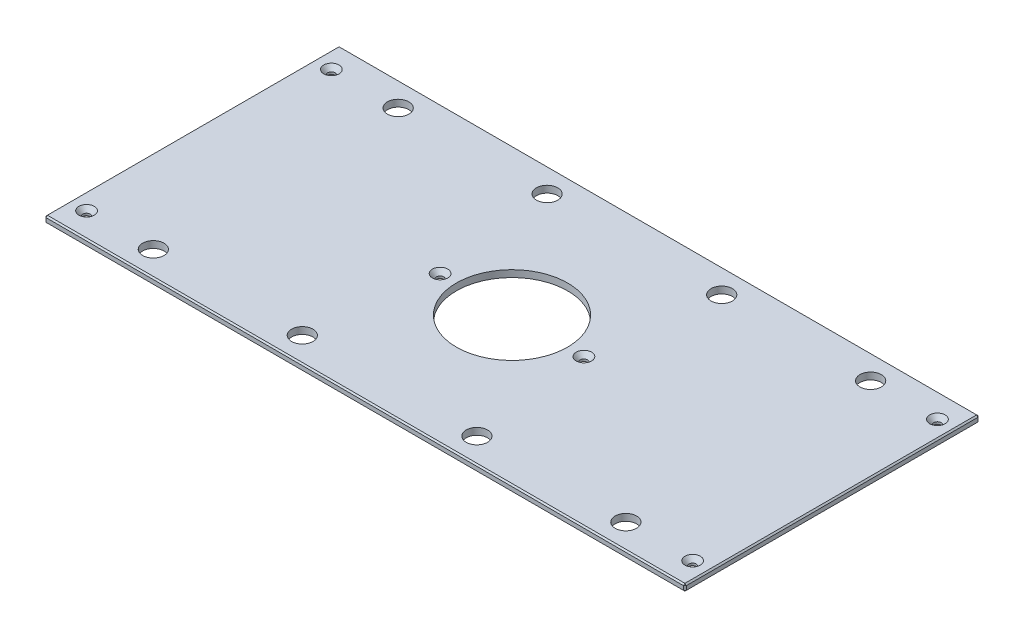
ISO-10303-21;
HEADER;
FILE_DESCRIPTION(('STEP AP214'),'2;1');
FILE_NAME('part.step','',(''),(''),'','','');
FILE_SCHEMA(('AUTOMOTIVE_DESIGN { 1 0 10303 214 1 1 1 1 }'));
ENDSEC;
DATA;
#1=APPLICATION_CONTEXT('core data for automotive mechanical design processes');
#2=APPLICATION_PROTOCOL_DEFINITION('international standard','automotive_design',2000,#1);
#3=PRODUCT_CONTEXT('',#1,'mechanical');
#4=PRODUCT('Part','Part','',(#3));
#5=PRODUCT_RELATED_PRODUCT_CATEGORY('part','',(#4));
#6=PRODUCT_DEFINITION_FORMATION('','',#4);
#7=PRODUCT_DEFINITION_CONTEXT('part definition',#1,'design');
#8=PRODUCT_DEFINITION('design','',#6,#7);
#9=PRODUCT_DEFINITION_SHAPE('','',#8);
#10=(LENGTH_UNIT() NAMED_UNIT(*) SI_UNIT(.MILLI.,.METRE.));
#11=(NAMED_UNIT(*) PLANE_ANGLE_UNIT() SI_UNIT($,.RADIAN.));
#12=(NAMED_UNIT(*) SI_UNIT($,.STERADIAN.) SOLID_ANGLE_UNIT());
#13=UNCERTAINTY_MEASURE_WITH_UNIT(LENGTH_MEASURE(1.E-05),#10,'distance_accuracy_value','');
#14=(GEOMETRIC_REPRESENTATION_CONTEXT(3) GLOBAL_UNCERTAINTY_ASSIGNED_CONTEXT((#13)) GLOBAL_UNIT_ASSIGNED_CONTEXT((#10,
#11,#12)) REPRESENTATION_CONTEXT('',''));
#15=CARTESIAN_POINT('',(0.,0.,0.));
#16=DIRECTION('',(0.,0.,1.));
#17=DIRECTION('',(1.,0.,0.));
#18=AXIS2_PLACEMENT_3D('',#15,#16,#17);
#19=CARTESIAN_POINT('',(-296.8625,6.35,-136.525));
#20=DIRECTION('',(1.,0.,0.));
#21=DIRECTION('',(0.,0.,-1.));
#22=AXIS2_PLACEMENT_3D('',#19,#20,#21);
#23=PLANE('',#22);
#24=DIRECTION('',(0.,0.,-1.));
#25=VECTOR('',#24,1.);
#26=CARTESIAN_POINT('',(-296.8625,5.08000000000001,-136.525));
#27=LINE('',#26,#25);
#28=CARTESIAN_POINT('',(-296.8625,5.08000000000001,135.255));
#29=VERTEX_POINT('',#28);
#30=CARTESIAN_POINT('',(-296.8625,5.08000000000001,-135.255));
#31=VERTEX_POINT('',#30);
#32=EDGE_CURVE('E136',#29,#31,#27,.T.);
#33=ORIENTED_EDGE('',*,*,#32,.T.);
#34=DIRECTION('',(0.,-1.,0.));
#35=VECTOR('',#34,1.);
#36=CARTESIAN_POINT('',(-296.8625,6.35,-135.255));
#37=LINE('',#36,#35);
#38=CARTESIAN_POINT('',(-296.8625,1.26999999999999,-135.255));
#39=VERTEX_POINT('',#38);
#40=EDGE_CURVE('E132',#31,#39,#37,.T.);
#41=ORIENTED_EDGE('',*,*,#40,.T.);
#42=DIRECTION('',(0.,0.,1.));
#43=VECTOR('',#42,1.);
#44=CARTESIAN_POINT('',(-296.8625,1.26999999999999,-136.525));
#45=LINE('',#44,#43);
#46=CARTESIAN_POINT('',(-296.8625,1.26999999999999,135.255));
#47=VERTEX_POINT('',#46);
#48=EDGE_CURVE('E127',#39,#47,#45,.T.);
#49=ORIENTED_EDGE('',*,*,#48,.T.);
#50=DIRECTION('',(0.,1.,0.));
#51=VECTOR('',#50,1.);
#52=CARTESIAN_POINT('',(-296.8625,6.35,135.255));
#53=LINE('',#52,#51);
#54=EDGE_CURVE('E129',#47,#29,#53,.T.);
#55=ORIENTED_EDGE('',*,*,#54,.T.);
#56=EDGE_LOOP('',(#33,#41,#49,#55));
#57=FACE_BOUND('',#56,.T.);
#58=ADVANCED_FACE('F36',(#57),#23,.F.);
#59=CARTESIAN_POINT('',(-296.8625,6.35,136.525));
#60=DIRECTION('',(0.,0.,-1.));
#61=DIRECTION('',(-1.,0.,0.));
#62=AXIS2_PLACEMENT_3D('',#59,#60,#61);
#63=PLANE('',#62);
#64=DIRECTION('',(1.,0.,0.));
#65=VECTOR('',#64,1.);
#66=CARTESIAN_POINT('',(-296.8625,1.26999999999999,136.525));
#67=LINE('',#66,#65);
#68=CARTESIAN_POINT('',(-295.5925,1.26999999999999,136.525));
#69=VERTEX_POINT('',#68);
#70=CARTESIAN_POINT('',(295.5925,1.26999999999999,136.525));
#71=VERTEX_POINT('',#70);
#72=EDGE_CURVE('E59',#69,#71,#67,.T.);
#73=ORIENTED_EDGE('',*,*,#72,.T.);
#74=DIRECTION('',(0.,1.,0.));
#75=VECTOR('',#74,1.);
#76=CARTESIAN_POINT('',(295.5925,6.35,136.525));
#77=LINE('',#76,#75);
#78=CARTESIAN_POINT('',(295.5925,5.08000000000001,136.525));
#79=VERTEX_POINT('',#78);
#80=EDGE_CURVE('E11',#71,#79,#77,.T.);
#81=ORIENTED_EDGE('',*,*,#80,.T.);
#82=DIRECTION('',(-1.,0.,0.));
#83=VECTOR('',#82,1.);
#84=CARTESIAN_POINT('',(-296.8625,5.08000000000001,136.525));
#85=LINE('',#84,#83);
#86=CARTESIAN_POINT('',(-295.5925,5.08000000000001,136.525));
#87=VERTEX_POINT('',#86);
#88=EDGE_CURVE('E45',#79,#87,#85,.T.);
#89=ORIENTED_EDGE('',*,*,#88,.T.);
#90=DIRECTION('',(0.,-1.,0.));
#91=VECTOR('',#90,1.);
#92=CARTESIAN_POINT('',(-295.5925,6.35,136.525));
#93=LINE('',#92,#91);
#94=EDGE_CURVE('E304',#87,#69,#93,.T.);
#95=ORIENTED_EDGE('',*,*,#94,.T.);
#96=EDGE_LOOP('',(#73,#81,#89,#95));
#97=FACE_BOUND('',#96,.T.);
#98=ADVANCED_FACE('F373',(#97),#63,.F.);
#99=CARTESIAN_POINT('',(296.8625,6.35,-136.525));
#100=DIRECTION('',(-1.,0.,0.));
#101=DIRECTION('',(0.,0.,1.));
#102=AXIS2_PLACEMENT_3D('',#99,#100,#101);
#103=PLANE('',#102);
#104=DIRECTION('',(0.,0.,-1.));
#105=VECTOR('',#104,1.);
#106=CARTESIAN_POINT('',(296.8625,1.26999999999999,-136.525));
#107=LINE('',#106,#105);
#108=CARTESIAN_POINT('',(296.8625,1.26999999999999,135.255));
#109=VERTEX_POINT('',#108);
#110=CARTESIAN_POINT('',(296.8625,1.26999999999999,-135.255));
#111=VERTEX_POINT('',#110);
#112=EDGE_CURVE('E299',#109,#111,#107,.T.);
#113=ORIENTED_EDGE('',*,*,#112,.T.);
#114=DIRECTION('',(0.,1.,0.));
#115=VECTOR('',#114,1.);
#116=CARTESIAN_POINT('',(296.8625,6.35,-135.255));
#117=LINE('',#116,#115);
#118=CARTESIAN_POINT('',(296.8625,5.08000000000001,-135.255));
#119=VERTEX_POINT('',#118);
#120=EDGE_CURVE('E301',#111,#119,#117,.T.);
#121=ORIENTED_EDGE('',*,*,#120,.T.);
#122=DIRECTION('',(0.,0.,1.));
#123=VECTOR('',#122,1.);
#124=CARTESIAN_POINT('',(296.8625,5.08000000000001,136.525));
#125=LINE('',#124,#123);
#126=CARTESIAN_POINT('',(296.8625,5.08000000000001,135.255));
#127=VERTEX_POINT('',#126);
#128=EDGE_CURVE('E297',#119,#127,#125,.T.);
#129=ORIENTED_EDGE('',*,*,#128,.T.);
#130=DIRECTION('',(0.,-1.,0.));
#131=VECTOR('',#130,1.);
#132=CARTESIAN_POINT('',(296.8625,6.35,135.255));
#133=LINE('',#132,#131);
#134=EDGE_CURVE('E295',#127,#109,#133,.T.);
#135=ORIENTED_EDGE('',*,*,#134,.T.);
#136=EDGE_LOOP('',(#113,#121,#129,#135));
#137=FACE_BOUND('',#136,.T.);
#138=ADVANCED_FACE('F360',(#137),#103,.F.);
#139=CARTESIAN_POINT('',(-296.8625,6.35,-136.525));
#140=DIRECTION('',(0.,0.,1.));
#141=DIRECTION('',(1.,0.,0.));
#142=AXIS2_PLACEMENT_3D('',#139,#140,#141);
#143=PLANE('',#142);
#144=DIRECTION('',(-1.,0.,0.));
#145=VECTOR('',#144,1.);
#146=CARTESIAN_POINT('',(-296.8625,1.26999999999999,-136.525));
#147=LINE('',#146,#145);
#148=CARTESIAN_POINT('',(295.5925,1.26999999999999,-136.525));
#149=VERTEX_POINT('',#148);
#150=CARTESIAN_POINT('',(-295.5925,1.26999999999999,-136.525));
#151=VERTEX_POINT('',#150);
#152=EDGE_CURVE('E271',#149,#151,#147,.T.);
#153=ORIENTED_EDGE('',*,*,#152,.T.);
#154=DIRECTION('',(0.,1.,0.));
#155=VECTOR('',#154,1.);
#156=CARTESIAN_POINT('',(-295.5925,6.35,-136.525));
#157=LINE('',#156,#155);
#158=CARTESIAN_POINT('',(-295.5925,5.08000000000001,-136.525));
#159=VERTEX_POINT('',#158);
#160=EDGE_CURVE('E275',#151,#159,#157,.T.);
#161=ORIENTED_EDGE('',*,*,#160,.T.);
#162=DIRECTION('',(1.,0.,0.));
#163=VECTOR('',#162,1.);
#164=CARTESIAN_POINT('',(296.8625,5.08000000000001,-136.525));
#165=LINE('',#164,#163);
#166=CARTESIAN_POINT('',(295.5925,5.08000000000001,-136.525));
#167=VERTEX_POINT('',#166);
#168=EDGE_CURVE('E273',#159,#167,#165,.T.);
#169=ORIENTED_EDGE('',*,*,#168,.T.);
#170=DIRECTION('',(0.,-1.,0.));
#171=VECTOR('',#170,1.);
#172=CARTESIAN_POINT('',(295.5925,6.35,-136.525));
#173=LINE('',#172,#171);
#174=EDGE_CURVE('E269',#167,#149,#173,.T.);
#175=ORIENTED_EDGE('',*,*,#174,.T.);
#176=EDGE_LOOP('',(#153,#161,#169,#175));
#177=FACE_BOUND('',#176,.T.);
#178=ADVANCED_FACE('F334',(#177),#143,.F.);
#179=CARTESIAN_POINT('',(0.,6.35,0.));
#180=DIRECTION('',(0.,1.,0.));
#181=DIRECTION('',(0.,0.,1.));
#182=AXIS2_PLACEMENT_3D('',#179,#180,#181);
#183=PLANE('',#182);
#184=CARTESIAN_POINT('',(280.9875,6.35,-113.50498));
#185=DIRECTION('',(0.,1.,0.));
#186=DIRECTION('',(0.,0.,1.));
#187=AXIS2_PLACEMENT_3D('',#184,#185,#186);
#188=CIRCLE('',#187,7.13740000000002);
#189=CARTESIAN_POINT('',(280.9875,6.35,-106.36758));
#190=VERTEX_POINT('',#189);
#191=EDGE_CURVE('E817',#190,#190,#188,.T.);
#192=ORIENTED_EDGE('',*,*,#191,.F.);
#193=EDGE_LOOP('',(#192));
#194=FACE_BOUND('',#193,.T.);
#195=CARTESIAN_POINT('',(280.9875,6.35,113.50498));
#196=DIRECTION('',(0.,1.,0.));
#197=DIRECTION('',(0.,0.,1.));
#198=AXIS2_PLACEMENT_3D('',#195,#196,#197);
#199=CIRCLE('',#198,7.13740000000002);
#200=CARTESIAN_POINT('',(280.9875,6.35,120.64238));
#201=VERTEX_POINT('',#200);
#202=EDGE_CURVE('E821',#201,#201,#199,.T.);
#203=ORIENTED_EDGE('',*,*,#202,.F.);
#204=EDGE_LOOP('',(#203));
#205=FACE_BOUND('',#204,.T.);
#206=CARTESIAN_POINT('',(-280.9875,6.35,113.50498));
#207=DIRECTION('',(0.,1.,0.));
#208=DIRECTION('',(0.,0.,1.));
#209=AXIS2_PLACEMENT_3D('',#206,#207,#208);
#210=CIRCLE('',#209,7.13740000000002);
#211=CARTESIAN_POINT('',(-280.9875,6.35,120.64238));
#212=VERTEX_POINT('',#211);
#213=EDGE_CURVE('E825',#212,#212,#210,.T.);
#214=ORIENTED_EDGE('',*,*,#213,.F.);
#215=EDGE_LOOP('',(#214));
#216=FACE_BOUND('',#215,.T.);
#217=CARTESIAN_POINT('',(-66.675,6.35,0.));
#218=DIRECTION('',(0.,1.,0.));
#219=DIRECTION('',(0.,0.,1.));
#220=AXIS2_PLACEMENT_3D('',#217,#218,#219);
#221=CIRCLE('',#220,7.1374);
#222=CARTESIAN_POINT('',(-66.675,6.35,7.1374));
#223=VERTEX_POINT('',#222);
#224=EDGE_CURVE('E829',#223,#223,#221,.T.);
#225=ORIENTED_EDGE('',*,*,#224,.F.);
#226=EDGE_LOOP('',(#225));
#227=FACE_BOUND('',#226,.T.);
#228=CARTESIAN_POINT('',(66.675,6.35,0.));
#229=DIRECTION('',(0.,1.,0.));
#230=DIRECTION('',(0.,0.,1.));
#231=AXIS2_PLACEMENT_3D('',#228,#229,#230);
#232=CIRCLE('',#231,7.1374);
#233=CARTESIAN_POINT('',(66.675,6.35,7.1374));
#234=VERTEX_POINT('',#233);
#235=EDGE_CURVE('E833',#234,#234,#232,.T.);
#236=ORIENTED_EDGE('',*,*,#235,.F.);
#237=EDGE_LOOP('',(#236));
#238=FACE_BOUND('',#237,.T.);
#239=CARTESIAN_POINT('',(-280.9875,6.35,-113.50498));
#240=DIRECTION('',(0.,1.,0.));
#241=DIRECTION('',(0.,0.,1.));
#242=AXIS2_PLACEMENT_3D('',#239,#240,#241);
#243=CIRCLE('',#242,7.13740000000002);
#244=CARTESIAN_POINT('',(-280.9875,6.35,-106.36758));
#245=VERTEX_POINT('',#244);
#246=EDGE_CURVE('E836',#245,#245,#243,.T.);
#247=ORIENTED_EDGE('',*,*,#246,.F.);
#248=EDGE_LOOP('',(#247));
#249=FACE_BOUND('',#248,.T.);
#250=DIRECTION('',(0.,0.,-1.));
#251=VECTOR('',#250,1.);
#252=CARTESIAN_POINT('',(295.5925,6.35,-136.525));
#253=LINE('',#252,#251);
#254=CARTESIAN_POINT('',(295.5925,6.35,135.255));
#255=VERTEX_POINT('',#254);
#256=CARTESIAN_POINT('',(295.5925,6.35,-135.255));
#257=VERTEX_POINT('',#256);
#258=EDGE_CURVE('E282',#255,#257,#253,.T.);
#259=ORIENTED_EDGE('',*,*,#258,.T.);
#260=DIRECTION('',(-1.,0.,0.));
#261=VECTOR('',#260,1.);
#262=CARTESIAN_POINT('',(-296.8625,6.35,-135.255));
#263=LINE('',#262,#261);
#264=CARTESIAN_POINT('',(-295.5925,6.35,-135.255));
#265=VERTEX_POINT('',#264);
#266=EDGE_CURVE('E284',#257,#265,#263,.T.);
#267=ORIENTED_EDGE('',*,*,#266,.T.);
#268=DIRECTION('',(0.,0.,1.));
#269=VECTOR('',#268,1.);
#270=CARTESIAN_POINT('',(-295.5925,6.35,136.525));
#271=LINE('',#270,#269);
#272=CARTESIAN_POINT('',(-295.5925,6.35,135.255));
#273=VERTEX_POINT('',#272);
#274=EDGE_CURVE('E280',#265,#273,#271,.T.);
#275=ORIENTED_EDGE('',*,*,#274,.T.);
#276=DIRECTION('',(1.,0.,0.));
#277=VECTOR('',#276,1.);
#278=CARTESIAN_POINT('',(296.8625,6.35,135.255));
#279=LINE('',#278,#277);
#280=EDGE_CURVE('E278',#273,#255,#279,.T.);
#281=ORIENTED_EDGE('',*,*,#280,.T.);
#282=EDGE_LOOP('',(#259,#267,#275,#281));
#283=FACE_BOUND('',#282,.T.);
#284=CARTESIAN_POINT('',(219.075,6.35,-113.50498));
#285=DIRECTION('',(0.,1.,0.));
#286=DIRECTION('',(0.,0.,1.));
#287=AXIS2_PLACEMENT_3D('',#284,#285,#286);
#288=CIRCLE('',#287,9.921875);
#289=CARTESIAN_POINT('',(219.075,6.35,-103.583105));
#290=VERTEX_POINT('',#289);
#291=EDGE_CURVE('E205',#290,#290,#288,.T.);
#292=ORIENTED_EDGE('',*,*,#291,.F.);
#293=EDGE_LOOP('',(#292));
#294=FACE_BOUND('',#293,.T.);
#295=CARTESIAN_POINT('',(-219.075,6.35,-113.50498));
#296=DIRECTION('',(0.,1.,0.));
#297=DIRECTION('',(0.,0.,1.));
#298=AXIS2_PLACEMENT_3D('',#295,#296,#297);
#299=CIRCLE('',#298,9.921875);
#300=CARTESIAN_POINT('',(-219.075,6.35,-103.583105));
#301=VERTEX_POINT('',#300);
#302=EDGE_CURVE('E215',#301,#301,#299,.T.);
#303=ORIENTED_EDGE('',*,*,#302,.F.);
#304=EDGE_LOOP('',(#303));
#305=FACE_BOUND('',#304,.T.);
#306=CARTESIAN_POINT('',(219.075,6.35,113.50498));
#307=DIRECTION('',(0.,1.,0.));
#308=DIRECTION('',(0.,0.,1.));
#309=AXIS2_PLACEMENT_3D('',#306,#307,#308);
#310=CIRCLE('',#309,9.921875);
#311=CARTESIAN_POINT('',(219.075,6.35,123.426855));
#312=VERTEX_POINT('',#311);
#313=EDGE_CURVE('E226',#312,#312,#310,.T.);
#314=ORIENTED_EDGE('',*,*,#313,.F.);
#315=EDGE_LOOP('',(#314));
#316=FACE_BOUND('',#315,.T.);
#317=CARTESIAN_POINT('',(-219.075,6.35,113.50498));
#318=DIRECTION('',(0.,1.,0.));
#319=DIRECTION('',(0.,0.,1.));
#320=AXIS2_PLACEMENT_3D('',#317,#318,#319);
#321=CIRCLE('',#320,9.921875);
#322=CARTESIAN_POINT('',(-219.075,6.35,123.426855));
#323=VERTEX_POINT('',#322);
#324=EDGE_CURVE('E232',#323,#323,#321,.T.);
#325=ORIENTED_EDGE('',*,*,#324,.F.);
#326=EDGE_LOOP('',(#325));
#327=FACE_BOUND('',#326,.T.);
#328=CARTESIAN_POINT('',(-80.9625,6.35,-113.50498));
#329=DIRECTION('',(0.,1.,0.));
#330=DIRECTION('',(0.,0.,1.));
#331=AXIS2_PLACEMENT_3D('',#328,#329,#330);
#332=CIRCLE('',#331,9.921875);
#333=CARTESIAN_POINT('',(-80.9625,6.35,-103.583105));
#334=VERTEX_POINT('',#333);
#335=EDGE_CURVE('E238',#334,#334,#332,.T.);
#336=ORIENTED_EDGE('',*,*,#335,.F.);
#337=EDGE_LOOP('',(#336));
#338=FACE_BOUND('',#337,.T.);
#339=CARTESIAN_POINT('',(80.9625,6.35,-113.50498));
#340=DIRECTION('',(0.,1.,0.));
#341=DIRECTION('',(0.,0.,1.));
#342=AXIS2_PLACEMENT_3D('',#339,#340,#341);
#343=CIRCLE('',#342,9.921875);
#344=CARTESIAN_POINT('',(80.9625,6.35,-103.583105));
#345=VERTEX_POINT('',#344);
#346=EDGE_CURVE('E244',#345,#345,#343,.T.);
#347=ORIENTED_EDGE('',*,*,#346,.F.);
#348=EDGE_LOOP('',(#347));
#349=FACE_BOUND('',#348,.T.);
#350=CARTESIAN_POINT('',(80.9625,6.35,113.50498));
#351=DIRECTION('',(0.,1.,0.));
#352=DIRECTION('',(0.,0.,1.));
#353=AXIS2_PLACEMENT_3D('',#350,#351,#352);
#354=CIRCLE('',#353,9.921875);
#355=CARTESIAN_POINT('',(80.9625,6.35,123.426855));
#356=VERTEX_POINT('',#355);
#357=EDGE_CURVE('E250',#356,#356,#354,.T.);
#358=ORIENTED_EDGE('',*,*,#357,.F.);
#359=EDGE_LOOP('',(#358));
#360=FACE_BOUND('',#359,.T.);
#361=CARTESIAN_POINT('',(-80.9625,6.35,113.50498));
#362=DIRECTION('',(0.,1.,0.));
#363=DIRECTION('',(0.,0.,1.));
#364=AXIS2_PLACEMENT_3D('',#361,#362,#363);
#365=CIRCLE('',#364,9.921875);
#366=CARTESIAN_POINT('',(-80.9625,6.35,123.426855));
#367=VERTEX_POINT('',#366);
#368=EDGE_CURVE('E256',#367,#367,#365,.T.);
#369=ORIENTED_EDGE('',*,*,#368,.F.);
#370=EDGE_LOOP('',(#369));
#371=FACE_BOUND('',#370,.T.);
#372=CARTESIAN_POINT('',(0.,6.35,0.));
#373=DIRECTION('',(0.,1.,0.));
#374=DIRECTION('',(0.,0.,1.));
#375=AXIS2_PLACEMENT_3D('',#372,#373,#374);
#376=CIRCLE('',#375,51.562);
#377=CARTESIAN_POINT('',(0.,6.35,51.562));
#378=VERTEX_POINT('',#377);
#379=EDGE_CURVE('E262',#378,#378,#376,.T.);
#380=ORIENTED_EDGE('',*,*,#379,.F.);
#381=EDGE_LOOP('',(#380));
#382=FACE_BOUND('',#381,.T.);
#383=ADVANCED_FACE('F382',(#194,#205,#216,#227,#238,#249,#283,#294,#305,#316,#327,#338,#349,
#360,#371,#382),#183,.T.);
#384=CARTESIAN_POINT('',(0.,0.,0.));
#385=DIRECTION('',(0.,1.,0.));
#386=DIRECTION('',(0.,0.,1.));
#387=AXIS2_PLACEMENT_3D('',#384,#385,#386);
#388=PLANE('',#387);
#389=CARTESIAN_POINT('',(280.9875,0.,-113.50498));
#390=DIRECTION('',(0.,1.,0.));
#391=DIRECTION('',(0.,0.,1.));
#392=AXIS2_PLACEMENT_3D('',#389,#390,#391);
#393=CIRCLE('',#392,3.3782);
#394=CARTESIAN_POINT('',(280.9875,0.,-110.12678));
#395=VERTEX_POINT('',#394);
#396=EDGE_CURVE('E870',#395,#395,#393,.T.);
#397=ORIENTED_EDGE('',*,*,#396,.T.);
#398=EDGE_LOOP('',(#397));
#399=FACE_BOUND('',#398,.T.);
#400=CARTESIAN_POINT('',(280.9875,0.,113.50498));
#401=DIRECTION('',(0.,1.,0.));
#402=DIRECTION('',(0.,0.,1.));
#403=AXIS2_PLACEMENT_3D('',#400,#401,#402);
#404=CIRCLE('',#403,3.3782);
#405=CARTESIAN_POINT('',(280.9875,0.,116.88318));
#406=VERTEX_POINT('',#405);
#407=EDGE_CURVE('E863',#406,#406,#404,.T.);
#408=ORIENTED_EDGE('',*,*,#407,.T.);
#409=EDGE_LOOP('',(#408));
#410=FACE_BOUND('',#409,.T.);
#411=CARTESIAN_POINT('',(-280.9875,0.,113.50498));
#412=DIRECTION('',(0.,1.,0.));
#413=DIRECTION('',(0.,0.,1.));
#414=AXIS2_PLACEMENT_3D('',#411,#412,#413);
#415=CIRCLE('',#414,3.3782);
#416=CARTESIAN_POINT('',(-280.9875,0.,116.88318));
#417=VERTEX_POINT('',#416);
#418=EDGE_CURVE('E856',#417,#417,#415,.T.);
#419=ORIENTED_EDGE('',*,*,#418,.T.);
#420=EDGE_LOOP('',(#419));
#421=FACE_BOUND('',#420,.T.);
#422=CARTESIAN_POINT('',(-66.675,0.,0.));
#423=DIRECTION('',(0.,1.,0.));
#424=DIRECTION('',(0.,0.,1.));
#425=AXIS2_PLACEMENT_3D('',#422,#423,#424);
#426=CIRCLE('',#425,3.3782);
#427=CARTESIAN_POINT('',(-66.675,0.,3.3782));
#428=VERTEX_POINT('',#427);
#429=EDGE_CURVE('E849',#428,#428,#426,.T.);
#430=ORIENTED_EDGE('',*,*,#429,.T.);
#431=EDGE_LOOP('',(#430));
#432=FACE_BOUND('',#431,.T.);
#433=CARTESIAN_POINT('',(66.675,0.,0.));
#434=DIRECTION('',(0.,1.,0.));
#435=DIRECTION('',(0.,0.,1.));
#436=AXIS2_PLACEMENT_3D('',#433,#434,#435);
#437=CIRCLE('',#436,3.3782);
#438=CARTESIAN_POINT('',(66.675,0.,3.3782));
#439=VERTEX_POINT('',#438);
#440=EDGE_CURVE('E839',#439,#439,#437,.T.);
#441=ORIENTED_EDGE('',*,*,#440,.T.);
#442=EDGE_LOOP('',(#441));
#443=FACE_BOUND('',#442,.T.);
#444=CARTESIAN_POINT('',(-280.9875,0.,-113.50498));
#445=DIRECTION('',(0.,1.,0.));
#446=DIRECTION('',(0.,0.,1.));
#447=AXIS2_PLACEMENT_3D('',#444,#445,#446);
#448=CIRCLE('',#447,3.3782);
#449=CARTESIAN_POINT('',(-280.9875,0.,-110.12678));
#450=VERTEX_POINT('',#449);
#451=EDGE_CURVE('E218',#450,#450,#448,.T.);
#452=ORIENTED_EDGE('',*,*,#451,.T.);
#453=EDGE_LOOP('',(#452));
#454=FACE_BOUND('',#453,.T.);
#455=DIRECTION('',(0.,0.,-1.));
#456=VECTOR('',#455,1.);
#457=CARTESIAN_POINT('',(-295.5925,0.,0.));
#458=LINE('',#457,#456);
#459=CARTESIAN_POINT('',(-295.5925,0.,135.255));
#460=VERTEX_POINT('',#459);
#461=CARTESIAN_POINT('',(-295.5925,0.,-135.255));
#462=VERTEX_POINT('',#461);
#463=EDGE_CURVE('E159',#460,#462,#458,.T.);
#464=ORIENTED_EDGE('',*,*,#463,.T.);
#465=DIRECTION('',(1.,0.,0.));
#466=VECTOR('',#465,1.);
#467=CARTESIAN_POINT('',(0.,0.,-135.255));
#468=LINE('',#467,#466);
#469=CARTESIAN_POINT('',(295.5925,0.,-135.255));
#470=VERTEX_POINT('',#469);
#471=EDGE_CURVE('E292',#462,#470,#468,.T.);
#472=ORIENTED_EDGE('',*,*,#471,.T.);
#473=DIRECTION('',(0.,0.,1.));
#474=VECTOR('',#473,1.);
#475=CARTESIAN_POINT('',(295.5925,0.,0.));
#476=LINE('',#475,#474);
#477=CARTESIAN_POINT('',(295.5925,0.,135.255));
#478=VERTEX_POINT('',#477);
#479=EDGE_CURVE('E290',#470,#478,#476,.T.);
#480=ORIENTED_EDGE('',*,*,#479,.T.);
#481=DIRECTION('',(-1.,0.,0.));
#482=VECTOR('',#481,1.);
#483=CARTESIAN_POINT('',(0.,0.,135.255));
#484=LINE('',#483,#482);
#485=EDGE_CURVE('E287',#478,#460,#484,.T.);
#486=ORIENTED_EDGE('',*,*,#485,.T.);
#487=EDGE_LOOP('',(#464,#472,#480,#486));
#488=FACE_BOUND('',#487,.T.);
#489=CARTESIAN_POINT('',(219.075,0.,-113.50498));
#490=DIRECTION('',(0.,1.,0.));
#491=DIRECTION('',(0.,0.,1.));
#492=AXIS2_PLACEMENT_3D('',#489,#490,#491);
#493=CIRCLE('',#492,9.921875);
#494=CARTESIAN_POINT('',(219.075,0.,-103.583105));
#495=VERTEX_POINT('',#494);
#496=EDGE_CURVE('E210',#495,#495,#493,.T.);
#497=ORIENTED_EDGE('',*,*,#496,.T.);
#498=EDGE_LOOP('',(#497));
#499=FACE_BOUND('',#498,.T.);
#500=CARTESIAN_POINT('',(-219.075,0.,-113.50498));
#501=DIRECTION('',(0.,1.,0.));
#502=DIRECTION('',(0.,0.,1.));
#503=AXIS2_PLACEMENT_3D('',#500,#501,#502);
#504=CIRCLE('',#503,9.921875);
#505=CARTESIAN_POINT('',(-219.075,0.,-103.583105));
#506=VERTEX_POINT('',#505);
#507=EDGE_CURVE('E223',#506,#506,#504,.T.);
#508=ORIENTED_EDGE('',*,*,#507,.T.);
#509=EDGE_LOOP('',(#508));
#510=FACE_BOUND('',#509,.T.);
#511=CARTESIAN_POINT('',(219.075,0.,113.50498));
#512=DIRECTION('',(0.,1.,0.));
#513=DIRECTION('',(0.,0.,1.));
#514=AXIS2_PLACEMENT_3D('',#511,#512,#513);
#515=CIRCLE('',#514,9.921875);
#516=CARTESIAN_POINT('',(219.075,0.,123.426855));
#517=VERTEX_POINT('',#516);
#518=EDGE_CURVE('E229',#517,#517,#515,.T.);
#519=ORIENTED_EDGE('',*,*,#518,.T.);
#520=EDGE_LOOP('',(#519));
#521=FACE_BOUND('',#520,.T.);
#522=CARTESIAN_POINT('',(-219.075,0.,113.50498));
#523=DIRECTION('',(0.,1.,0.));
#524=DIRECTION('',(0.,0.,1.));
#525=AXIS2_PLACEMENT_3D('',#522,#523,#524);
#526=CIRCLE('',#525,9.921875);
#527=CARTESIAN_POINT('',(-219.075,0.,123.426855));
#528=VERTEX_POINT('',#527);
#529=EDGE_CURVE('E235',#528,#528,#526,.T.);
#530=ORIENTED_EDGE('',*,*,#529,.T.);
#531=EDGE_LOOP('',(#530));
#532=FACE_BOUND('',#531,.T.);
#533=CARTESIAN_POINT('',(-80.9625,0.,-113.50498));
#534=DIRECTION('',(0.,1.,0.));
#535=DIRECTION('',(0.,0.,1.));
#536=AXIS2_PLACEMENT_3D('',#533,#534,#535);
#537=CIRCLE('',#536,9.921875);
#538=CARTESIAN_POINT('',(-80.9625,0.,-103.583105));
#539=VERTEX_POINT('',#538);
#540=EDGE_CURVE('E241',#539,#539,#537,.T.);
#541=ORIENTED_EDGE('',*,*,#540,.T.);
#542=EDGE_LOOP('',(#541));
#543=FACE_BOUND('',#542,.T.);
#544=CARTESIAN_POINT('',(80.9625,0.,-113.50498));
#545=DIRECTION('',(0.,1.,0.));
#546=DIRECTION('',(0.,0.,1.));
#547=AXIS2_PLACEMENT_3D('',#544,#545,#546);
#548=CIRCLE('',#547,9.921875);
#549=CARTESIAN_POINT('',(80.9625,0.,-103.583105));
#550=VERTEX_POINT('',#549);
#551=EDGE_CURVE('E247',#550,#550,#548,.T.);
#552=ORIENTED_EDGE('',*,*,#551,.T.);
#553=EDGE_LOOP('',(#552));
#554=FACE_BOUND('',#553,.T.);
#555=CARTESIAN_POINT('',(80.9625,0.,113.50498));
#556=DIRECTION('',(0.,1.,0.));
#557=DIRECTION('',(0.,0.,1.));
#558=AXIS2_PLACEMENT_3D('',#555,#556,#557);
#559=CIRCLE('',#558,9.921875);
#560=CARTESIAN_POINT('',(80.9625,0.,123.426855));
#561=VERTEX_POINT('',#560);
#562=EDGE_CURVE('E253',#561,#561,#559,.T.);
#563=ORIENTED_EDGE('',*,*,#562,.T.);
#564=EDGE_LOOP('',(#563));
#565=FACE_BOUND('',#564,.T.);
#566=CARTESIAN_POINT('',(-80.9625,0.,113.50498));
#567=DIRECTION('',(0.,1.,0.));
#568=DIRECTION('',(0.,0.,1.));
#569=AXIS2_PLACEMENT_3D('',#566,#567,#568);
#570=CIRCLE('',#569,9.921875);
#571=CARTESIAN_POINT('',(-80.9625,0.,123.426855));
#572=VERTEX_POINT('',#571);
#573=EDGE_CURVE('E259',#572,#572,#570,.T.);
#574=ORIENTED_EDGE('',*,*,#573,.T.);
#575=EDGE_LOOP('',(#574));
#576=FACE_BOUND('',#575,.T.);
#577=CARTESIAN_POINT('',(0.,0.,0.));
#578=DIRECTION('',(0.,1.,0.));
#579=DIRECTION('',(0.,0.,1.));
#580=AXIS2_PLACEMENT_3D('',#577,#578,#579);
#581=CIRCLE('',#580,51.562);
#582=CARTESIAN_POINT('',(0.,0.,51.562));
#583=VERTEX_POINT('',#582);
#584=EDGE_CURVE('E148',#583,#583,#581,.T.);
#585=ORIENTED_EDGE('',*,*,#584,.T.);
#586=EDGE_LOOP('',(#585));
#587=FACE_BOUND('',#586,.T.);
#588=ADVANCED_FACE('F347',(#399,#410,#421,#432,#443,#454,#488,#499,#510,#521,#532,#543,#554,
#565,#576,#587),#388,.F.);
#589=CARTESIAN_POINT('',(0.,0.,0.));
#590=DIRECTION('',(0.,1.,0.));
#591=DIRECTION('',(0.,0.,1.));
#592=AXIS2_PLACEMENT_3D('',#589,#590,#591);
#593=CYLINDRICAL_SURFACE('',#592,51.562);
#594=ORIENTED_EDGE('',*,*,#584,.F.);
#595=EDGE_LOOP('',(#594));
#596=FACE_BOUND('',#595,.T.);
#597=ORIENTED_EDGE('',*,*,#379,.T.);
#598=EDGE_LOOP('',(#597));
#599=FACE_BOUND('',#598,.T.);
#600=ADVANCED_FACE('F752',(#596,#599),#593,.F.);
#601=CARTESIAN_POINT('',(-80.9625,6.35,113.50498));
#602=DIRECTION('',(0.,1.,0.));
#603=DIRECTION('',(0.,0.,1.));
#604=AXIS2_PLACEMENT_3D('',#601,#602,#603);
#605=CYLINDRICAL_SURFACE('',#604,9.921875);
#606=ORIENTED_EDGE('',*,*,#573,.F.);
#607=EDGE_LOOP('',(#606));
#608=FACE_BOUND('',#607,.T.);
#609=ORIENTED_EDGE('',*,*,#368,.T.);
#610=EDGE_LOOP('',(#609));
#611=FACE_BOUND('',#610,.T.);
#612=ADVANCED_FACE('F743',(#608,#611),#605,.F.);
#613=CARTESIAN_POINT('',(80.9625,6.35,113.50498));
#614=DIRECTION('',(0.,1.,0.));
#615=DIRECTION('',(0.,0.,1.));
#616=AXIS2_PLACEMENT_3D('',#613,#614,#615);
#617=CYLINDRICAL_SURFACE('',#616,9.921875);
#618=ORIENTED_EDGE('',*,*,#562,.F.);
#619=EDGE_LOOP('',(#618));
#620=FACE_BOUND('',#619,.T.);
#621=ORIENTED_EDGE('',*,*,#357,.T.);
#622=EDGE_LOOP('',(#621));
#623=FACE_BOUND('',#622,.T.);
#624=ADVANCED_FACE('F734',(#620,#623),#617,.F.);
#625=CARTESIAN_POINT('',(80.9625,6.35,-113.50498));
#626=DIRECTION('',(0.,1.,0.));
#627=DIRECTION('',(0.,0.,1.));
#628=AXIS2_PLACEMENT_3D('',#625,#626,#627);
#629=CYLINDRICAL_SURFACE('',#628,9.921875);
#630=ORIENTED_EDGE('',*,*,#551,.F.);
#631=EDGE_LOOP('',(#630));
#632=FACE_BOUND('',#631,.T.);
#633=ORIENTED_EDGE('',*,*,#346,.T.);
#634=EDGE_LOOP('',(#633));
#635=FACE_BOUND('',#634,.T.);
#636=ADVANCED_FACE('F725',(#632,#635),#629,.F.);
#637=CARTESIAN_POINT('',(-80.9625,6.35,-113.50498));
#638=DIRECTION('',(0.,1.,0.));
#639=DIRECTION('',(0.,0.,1.));
#640=AXIS2_PLACEMENT_3D('',#637,#638,#639);
#641=CYLINDRICAL_SURFACE('',#640,9.921875);
#642=ORIENTED_EDGE('',*,*,#540,.F.);
#643=EDGE_LOOP('',(#642));
#644=FACE_BOUND('',#643,.T.);
#645=ORIENTED_EDGE('',*,*,#335,.T.);
#646=EDGE_LOOP('',(#645));
#647=FACE_BOUND('',#646,.T.);
#648=ADVANCED_FACE('F716',(#644,#647),#641,.F.);
#649=CARTESIAN_POINT('',(-219.075,6.35,113.50498));
#650=DIRECTION('',(0.,1.,0.));
#651=DIRECTION('',(0.,0.,1.));
#652=AXIS2_PLACEMENT_3D('',#649,#650,#651);
#653=CYLINDRICAL_SURFACE('',#652,9.921875);
#654=ORIENTED_EDGE('',*,*,#529,.F.);
#655=EDGE_LOOP('',(#654));
#656=FACE_BOUND('',#655,.T.);
#657=ORIENTED_EDGE('',*,*,#324,.T.);
#658=EDGE_LOOP('',(#657));
#659=FACE_BOUND('',#658,.T.);
#660=ADVANCED_FACE('F707',(#656,#659),#653,.F.);
#661=CARTESIAN_POINT('',(219.075,6.35,113.50498));
#662=DIRECTION('',(0.,1.,0.));
#663=DIRECTION('',(0.,0.,1.));
#664=AXIS2_PLACEMENT_3D('',#661,#662,#663);
#665=CYLINDRICAL_SURFACE('',#664,9.921875);
#666=ORIENTED_EDGE('',*,*,#518,.F.);
#667=EDGE_LOOP('',(#666));
#668=FACE_BOUND('',#667,.T.);
#669=ORIENTED_EDGE('',*,*,#313,.T.);
#670=EDGE_LOOP('',(#669));
#671=FACE_BOUND('',#670,.T.);
#672=ADVANCED_FACE('F698',(#668,#671),#665,.F.);
#673=CARTESIAN_POINT('',(-219.075,6.35,-113.50498));
#674=DIRECTION('',(0.,1.,0.));
#675=DIRECTION('',(0.,0.,1.));
#676=AXIS2_PLACEMENT_3D('',#673,#674,#675);
#677=CYLINDRICAL_SURFACE('',#676,9.921875);
#678=ORIENTED_EDGE('',*,*,#507,.F.);
#679=EDGE_LOOP('',(#678));
#680=FACE_BOUND('',#679,.T.);
#681=ORIENTED_EDGE('',*,*,#302,.T.);
#682=EDGE_LOOP('',(#681));
#683=FACE_BOUND('',#682,.T.);
#684=ADVANCED_FACE('F688',(#680,#683),#677,.F.);
#685=CARTESIAN_POINT('',(219.075,6.35,-113.50498));
#686=DIRECTION('',(0.,1.,0.));
#687=DIRECTION('',(0.,0.,1.));
#688=AXIS2_PLACEMENT_3D('',#685,#686,#687);
#689=CYLINDRICAL_SURFACE('',#688,9.921875);
#690=ORIENTED_EDGE('',*,*,#496,.F.);
#691=EDGE_LOOP('',(#690));
#692=FACE_BOUND('',#691,.T.);
#693=ORIENTED_EDGE('',*,*,#291,.T.);
#694=EDGE_LOOP('',(#693));
#695=FACE_BOUND('',#694,.T.);
#696=ADVANCED_FACE('F391',(#692,#695),#689,.F.);
#697=CARTESIAN_POINT('',(296.8625,6.35,135.255));
#698=DIRECTION('',(-0.707106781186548,0.,-0.707106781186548));
#699=DIRECTION('',(0.,-1.,0.));
#700=AXIS2_PLACEMENT_3D('',#697,#698,#699);
#701=PLANE('',#700);
#702=DIRECTION('',(-0.707106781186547,0.,0.707106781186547));
#703=VECTOR('',#702,1.);
#704=CARTESIAN_POINT('',(296.8625,5.08000000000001,135.255));
#705=LINE('',#704,#703);
#706=EDGE_CURVE('E40',#79,#127,#705,.F.);
#707=ORIENTED_EDGE('',*,*,#706,.F.);
#708=ORIENTED_EDGE('',*,*,#80,.F.);
#709=DIRECTION('',(0.707106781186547,0.,-0.707106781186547));
#710=VECTOR('',#709,1.);
#711=CARTESIAN_POINT('',(296.2275,1.26999999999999,135.89));
#712=LINE('',#711,#710);
#713=EDGE_CURVE('E198',#109,#71,#712,.F.);
#714=ORIENTED_EDGE('',*,*,#713,.F.);
#715=ORIENTED_EDGE('',*,*,#134,.F.);
#716=EDGE_LOOP('',(#707,#708,#714,#715));
#717=FACE_BOUND('',#716,.T.);
#718=ADVANCED_FACE('F38',(#717),#701,.F.);
#719=CARTESIAN_POINT('',(296.8625,5.08000000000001,135.255));
#720=DIRECTION('',(0.577350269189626,0.577350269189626,0.577350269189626));
#721=DIRECTION('',(0.707106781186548,0.,-0.707106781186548));
#722=AXIS2_PLACEMENT_3D('',#719,#720,#721);
#723=PLANE('',#722);
#724=DIRECTION('',(0.,-0.707106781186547,0.707106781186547));
#725=VECTOR('',#724,1.);
#726=CARTESIAN_POINT('',(295.5925,5.715,135.89));
#727=LINE('',#726,#725);
#728=EDGE_CURVE('E194',#79,#255,#727,.F.);
#729=ORIENTED_EDGE('',*,*,#728,.F.);
#730=ORIENTED_EDGE('',*,*,#706,.T.);
#731=DIRECTION('',(-0.707106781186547,0.707106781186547,0.));
#732=VECTOR('',#731,1.);
#733=CARTESIAN_POINT('',(296.8625,5.08000000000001,135.255));
#734=LINE('',#733,#732);
#735=EDGE_CURVE('E196',#255,#127,#734,.F.);
#736=ORIENTED_EDGE('',*,*,#735,.F.);
#737=EDGE_LOOP('',(#729,#730,#736));
#738=FACE_BOUND('',#737,.T.);
#739=ADVANCED_FACE('F384',(#738),#723,.T.);
#740=CARTESIAN_POINT('',(295.5925,0.,135.255));
#741=DIRECTION('',(0.577350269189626,-0.577350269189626,0.577350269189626));
#742=DIRECTION('',(0.707106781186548,0.,-0.707106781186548));
#743=AXIS2_PLACEMENT_3D('',#740,#741,#742);
#744=PLANE('',#743);
#745=DIRECTION('',(-0.707106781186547,-0.707106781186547,0.));
#746=VECTOR('',#745,1.);
#747=CARTESIAN_POINT('',(295.5925,0.,135.255));
#748=LINE('',#747,#746);
#749=EDGE_CURVE('E188',#109,#478,#748,.T.);
#750=ORIENTED_EDGE('',*,*,#749,.F.);
#751=ORIENTED_EDGE('',*,*,#713,.T.);
#752=DIRECTION('',(0.,0.707106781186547,0.707106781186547));
#753=VECTOR('',#752,1.);
#754=CARTESIAN_POINT('',(295.5925,0.,135.255));
#755=LINE('',#754,#753);
#756=EDGE_CURVE('E191',#478,#71,#755,.T.);
#757=ORIENTED_EDGE('',*,*,#756,.F.);
#758=EDGE_LOOP('',(#750,#751,#757));
#759=FACE_BOUND('',#758,.T.);
#760=ADVANCED_FACE('F353',(#759),#744,.T.);
#761=CARTESIAN_POINT('',(295.5925,6.35,0.));
#762=DIRECTION('',(0.707106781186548,0.707106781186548,0.));
#763=DIRECTION('',(0.,0.,1.));
#764=AXIS2_PLACEMENT_3D('',#761,#762,#763);
#765=PLANE('',#764);
#766=ORIENTED_EDGE('',*,*,#735,.T.);
#767=ORIENTED_EDGE('',*,*,#128,.F.);
#768=DIRECTION('',(0.707106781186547,-0.707106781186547,0.));
#769=VECTOR('',#768,1.);
#770=CARTESIAN_POINT('',(296.2275,5.715,-135.255));
#771=LINE('',#770,#769);
#772=EDGE_CURVE('E183',#257,#119,#771,.T.);
#773=ORIENTED_EDGE('',*,*,#772,.F.);
#774=ORIENTED_EDGE('',*,*,#258,.F.);
#775=EDGE_LOOP('',(#766,#767,#773,#774));
#776=FACE_BOUND('',#775,.T.);
#777=ADVANCED_FACE('F370',(#776),#765,.T.);
#778=CARTESIAN_POINT('',(0.,6.35,135.255));
#779=DIRECTION('',(0.,0.707106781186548,0.707106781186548));
#780=DIRECTION('',(-1.,0.,0.));
#781=AXIS2_PLACEMENT_3D('',#778,#779,#780);
#782=PLANE('',#781);
#783=ORIENTED_EDGE('',*,*,#728,.T.);
#784=ORIENTED_EDGE('',*,*,#280,.F.);
#785=DIRECTION('',(0.,0.707106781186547,-0.707106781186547));
#786=VECTOR('',#785,1.);
#787=CARTESIAN_POINT('',(-295.5925,6.35,135.255));
#788=LINE('',#787,#786);
#789=EDGE_CURVE('E180',#87,#273,#788,.T.);
#790=ORIENTED_EDGE('',*,*,#789,.F.);
#791=ORIENTED_EDGE('',*,*,#88,.F.);
#792=EDGE_LOOP('',(#783,#784,#790,#791));
#793=FACE_BOUND('',#792,.T.);
#794=ADVANCED_FACE('F375',(#793),#782,.T.);
#795=CARTESIAN_POINT('',(-295.5925,6.35,136.525));
#796=DIRECTION('',(0.707106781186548,0.,-0.707106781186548));
#797=DIRECTION('',(0.,-1.,0.));
#798=AXIS2_PLACEMENT_3D('',#795,#796,#797);
#799=PLANE('',#798);
#800=DIRECTION('',(0.707106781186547,0.,0.707106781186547));
#801=VECTOR('',#800,1.);
#802=CARTESIAN_POINT('',(-296.8625,1.26999999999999,135.255));
#803=LINE('',#802,#801);
#804=EDGE_CURVE('E143',#69,#47,#803,.F.);
#805=ORIENTED_EDGE('',*,*,#804,.F.);
#806=ORIENTED_EDGE('',*,*,#94,.F.);
#807=DIRECTION('',(-0.707106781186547,0.,-0.707106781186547));
#808=VECTOR('',#807,1.);
#809=CARTESIAN_POINT('',(-296.2275,5.08000000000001,135.89));
#810=LINE('',#809,#808);
#811=EDGE_CURVE('E146',#29,#87,#810,.F.);
#812=ORIENTED_EDGE('',*,*,#811,.F.);
#813=ORIENTED_EDGE('',*,*,#54,.F.);
#814=EDGE_LOOP('',(#805,#806,#812,#813));
#815=FACE_BOUND('',#814,.T.);
#816=ADVANCED_FACE('F141',(#815),#799,.F.);
#817=CARTESIAN_POINT('',(-296.8625,1.26999999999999,136.525));
#818=DIRECTION('',(0.,0.707106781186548,-0.707106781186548));
#819=DIRECTION('',(1.,0.,0.));
#820=AXIS2_PLACEMENT_3D('',#817,#818,#819);
#821=PLANE('',#820);
#822=ORIENTED_EDGE('',*,*,#756,.T.);
#823=ORIENTED_EDGE('',*,*,#72,.F.);
#824=DIRECTION('',(0.,-0.707106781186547,-0.707106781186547));
#825=VECTOR('',#824,1.);
#826=CARTESIAN_POINT('',(-295.5925,0.634999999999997,135.89));
#827=LINE('',#826,#825);
#828=EDGE_CURVE('E156',#460,#69,#827,.F.);
#829=ORIENTED_EDGE('',*,*,#828,.F.);
#830=ORIENTED_EDGE('',*,*,#485,.F.);
#831=EDGE_LOOP('',(#822,#823,#829,#830));
#832=FACE_BOUND('',#831,.T.);
#833=ADVANCED_FACE('F352',(#832),#821,.F.);
#834=CARTESIAN_POINT('',(296.8625,1.26999999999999,-136.525));
#835=DIRECTION('',(-0.707106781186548,0.707106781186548,0.));
#836=DIRECTION('',(0.,0.,-1.));
#837=AXIS2_PLACEMENT_3D('',#834,#835,#836);
#838=PLANE('',#837);
#839=ORIENTED_EDGE('',*,*,#749,.T.);
#840=ORIENTED_EDGE('',*,*,#479,.F.);
#841=DIRECTION('',(0.707106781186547,0.707106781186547,0.));
#842=VECTOR('',#841,1.);
#843=CARTESIAN_POINT('',(295.5925,0.,-135.255));
#844=LINE('',#843,#842);
#845=EDGE_CURVE('E175',#111,#470,#844,.F.);
#846=ORIENTED_EDGE('',*,*,#845,.F.);
#847=ORIENTED_EDGE('',*,*,#112,.F.);
#848=EDGE_LOOP('',(#839,#840,#846,#847));
#849=FACE_BOUND('',#848,.T.);
#850=ADVANCED_FACE('F357',(#849),#838,.F.);
#851=CARTESIAN_POINT('',(295.5925,6.35,-136.525));
#852=DIRECTION('',(-0.707106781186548,0.,0.707106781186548));
#853=DIRECTION('',(0.,-1.,0.));
#854=AXIS2_PLACEMENT_3D('',#851,#852,#853);
#855=PLANE('',#854);
#856=DIRECTION('',(0.707106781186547,0.,0.707106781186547));
#857=VECTOR('',#856,1.);
#858=CARTESIAN_POINT('',(295.5925,5.08000000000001,-136.525));
#859=LINE('',#858,#857);
#860=EDGE_CURVE('E185',#119,#167,#859,.F.);
#861=ORIENTED_EDGE('',*,*,#860,.F.);
#862=ORIENTED_EDGE('',*,*,#120,.F.);
#863=DIRECTION('',(-0.707106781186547,0.,-0.707106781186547));
#864=VECTOR('',#863,1.);
#865=CARTESIAN_POINT('',(296.2275,1.26999999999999,-135.89));
#866=LINE('',#865,#864);
#867=EDGE_CURVE('E172',#149,#111,#866,.F.);
#868=ORIENTED_EDGE('',*,*,#867,.F.);
#869=ORIENTED_EDGE('',*,*,#174,.F.);
#870=EDGE_LOOP('',(#861,#862,#868,#869));
#871=FACE_BOUND('',#870,.T.);
#872=ADVANCED_FACE('F365',(#871),#855,.F.);
#873=CARTESIAN_POINT('',(295.5925,5.08000000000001,-136.525));
#874=DIRECTION('',(0.577350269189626,0.577350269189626,-0.577350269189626));
#875=DIRECTION('',(-0.707106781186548,0.,-0.707106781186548));
#876=AXIS2_PLACEMENT_3D('',#873,#874,#875);
#877=PLANE('',#876);
#878=ORIENTED_EDGE('',*,*,#772,.T.);
#879=ORIENTED_EDGE('',*,*,#860,.T.);
#880=DIRECTION('',(0.,0.707106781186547,0.707106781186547));
#881=VECTOR('',#880,1.);
#882=CARTESIAN_POINT('',(295.5925,5.08000000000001,-136.525));
#883=LINE('',#882,#881);
#884=EDGE_CURVE('E164',#257,#167,#883,.F.);
#885=ORIENTED_EDGE('',*,*,#884,.F.);
#886=EDGE_LOOP('',(#878,#879,#885));
#887=FACE_BOUND('',#886,.T.);
#888=ADVANCED_FACE('F423',(#887),#877,.T.);
#889=CARTESIAN_POINT('',(-295.5925,6.35,135.255));
#890=DIRECTION('',(-0.577350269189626,0.577350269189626,0.577350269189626));
#891=DIRECTION('',(0.707106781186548,0.,0.707106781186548));
#892=AXIS2_PLACEMENT_3D('',#889,#890,#891);
#893=PLANE('',#892);
#894=ORIENTED_EDGE('',*,*,#811,.T.);
#895=ORIENTED_EDGE('',*,*,#789,.T.);
#896=DIRECTION('',(-0.707106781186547,-0.707106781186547,0.));
#897=VECTOR('',#896,1.);
#898=CARTESIAN_POINT('',(-295.5925,6.35,135.255));
#899=LINE('',#898,#897);
#900=EDGE_CURVE('E160',#29,#273,#899,.F.);
#901=ORIENTED_EDGE('',*,*,#900,.F.);
#902=EDGE_LOOP('',(#894,#895,#901));
#903=FACE_BOUND('',#902,.T.);
#904=ADVANCED_FACE('F377',(#903),#893,.T.);
#905=CARTESIAN_POINT('',(-296.8625,1.26999999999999,135.255));
#906=DIRECTION('',(-0.577350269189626,-0.577350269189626,0.577350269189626));
#907=DIRECTION('',(0.707106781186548,0.,0.707106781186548));
#908=AXIS2_PLACEMENT_3D('',#905,#906,#907);
#909=PLANE('',#908);
#910=ORIENTED_EDGE('',*,*,#828,.T.);
#911=ORIENTED_EDGE('',*,*,#804,.T.);
#912=DIRECTION('',(-0.707106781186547,0.707106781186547,0.));
#913=VECTOR('',#912,1.);
#914=CARTESIAN_POINT('',(-296.8625,1.26999999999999,135.255));
#915=LINE('',#914,#913);
#916=EDGE_CURVE('E153',#460,#47,#915,.T.);
#917=ORIENTED_EDGE('',*,*,#916,.F.);
#918=EDGE_LOOP('',(#910,#911,#917));
#919=FACE_BOUND('',#918,.T.);
#920=ADVANCED_FACE('F152',(#919),#909,.T.);
#921=CARTESIAN_POINT('',(295.5925,0.,-135.255));
#922=DIRECTION('',(0.577350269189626,-0.577350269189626,-0.577350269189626));
#923=DIRECTION('',(-0.707106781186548,0.,-0.707106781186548));
#924=AXIS2_PLACEMENT_3D('',#921,#922,#923);
#925=PLANE('',#924);
#926=ORIENTED_EDGE('',*,*,#867,.T.);
#927=ORIENTED_EDGE('',*,*,#845,.T.);
#928=DIRECTION('',(0.,-0.707106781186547,0.707106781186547));
#929=VECTOR('',#928,1.);
#930=CARTESIAN_POINT('',(295.5925,0.,-135.255));
#931=LINE('',#930,#929);
#932=EDGE_CURVE('E161',#149,#470,#931,.T.);
#933=ORIENTED_EDGE('',*,*,#932,.F.);
#934=EDGE_LOOP('',(#926,#927,#933));
#935=FACE_BOUND('',#934,.T.);
#936=ADVANCED_FACE('F415',(#935),#925,.T.);
#937=CARTESIAN_POINT('',(0.,6.35,-135.255));
#938=DIRECTION('',(0.,0.707106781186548,-0.707106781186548));
#939=DIRECTION('',(1.,0.,0.));
#940=AXIS2_PLACEMENT_3D('',#937,#938,#939);
#941=PLANE('',#940);
#942=ORIENTED_EDGE('',*,*,#884,.T.);
#943=ORIENTED_EDGE('',*,*,#168,.F.);
#944=DIRECTION('',(0.,-0.707106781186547,-0.707106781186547));
#945=VECTOR('',#944,1.);
#946=CARTESIAN_POINT('',(-295.5925,5.08000000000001,-136.525));
#947=LINE('',#946,#945);
#948=EDGE_CURVE('E166',#265,#159,#947,.T.);
#949=ORIENTED_EDGE('',*,*,#948,.F.);
#950=ORIENTED_EDGE('',*,*,#266,.F.);
#951=EDGE_LOOP('',(#942,#943,#949,#950));
#952=FACE_BOUND('',#951,.T.);
#953=ADVANCED_FACE('F329',(#952),#941,.T.);
#954=CARTESIAN_POINT('',(-295.5925,6.35,0.));
#955=DIRECTION('',(-0.707106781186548,0.707106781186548,0.));
#956=DIRECTION('',(0.,0.,-1.));
#957=AXIS2_PLACEMENT_3D('',#954,#955,#956);
#958=PLANE('',#957);
#959=ORIENTED_EDGE('',*,*,#900,.T.);
#960=ORIENTED_EDGE('',*,*,#274,.F.);
#961=DIRECTION('',(0.707106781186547,0.707106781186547,0.));
#962=VECTOR('',#961,1.);
#963=CARTESIAN_POINT('',(-296.2275,5.715,-135.255));
#964=LINE('',#963,#962);
#965=EDGE_CURVE('E318',#31,#265,#964,.T.);
#966=ORIENTED_EDGE('',*,*,#965,.F.);
#967=ORIENTED_EDGE('',*,*,#32,.F.);
#968=EDGE_LOOP('',(#959,#960,#966,#967));
#969=FACE_BOUND('',#968,.T.);
#970=ADVANCED_FACE('F380',(#969),#958,.T.);
#971=CARTESIAN_POINT('',(-296.8625,1.26999999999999,-136.525));
#972=DIRECTION('',(0.707106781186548,0.707106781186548,0.));
#973=DIRECTION('',(0.,0.,1.));
#974=AXIS2_PLACEMENT_3D('',#971,#972,#973);
#975=PLANE('',#974);
#976=ORIENTED_EDGE('',*,*,#916,.T.);
#977=ORIENTED_EDGE('',*,*,#48,.F.);
#978=DIRECTION('',(0.707106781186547,-0.707106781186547,0.));
#979=VECTOR('',#978,1.);
#980=CARTESIAN_POINT('',(-296.8625,1.26999999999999,-135.255));
#981=LINE('',#980,#979);
#982=EDGE_CURVE('E315',#462,#39,#981,.F.);
#983=ORIENTED_EDGE('',*,*,#982,.F.);
#984=ORIENTED_EDGE('',*,*,#463,.F.);
#985=EDGE_LOOP('',(#976,#977,#983,#984));
#986=FACE_BOUND('',#985,.T.);
#987=ADVANCED_FACE('F158',(#986),#975,.F.);
#988=CARTESIAN_POINT('',(-296.8625,1.26999999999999,-136.525));
#989=DIRECTION('',(0.,0.707106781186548,0.707106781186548));
#990=DIRECTION('',(-1.,0.,0.));
#991=AXIS2_PLACEMENT_3D('',#988,#989,#990);
#992=PLANE('',#991);
#993=ORIENTED_EDGE('',*,*,#932,.T.);
#994=ORIENTED_EDGE('',*,*,#471,.F.);
#995=DIRECTION('',(0.,0.707106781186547,-0.707106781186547));
#996=VECTOR('',#995,1.);
#997=CARTESIAN_POINT('',(-295.5925,0.634999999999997,-135.89));
#998=LINE('',#997,#996);
#999=EDGE_CURVE('E312',#151,#462,#998,.F.);
#1000=ORIENTED_EDGE('',*,*,#999,.F.);
#1001=ORIENTED_EDGE('',*,*,#152,.F.);
#1002=EDGE_LOOP('',(#993,#994,#1000,#1001));
#1003=FACE_BOUND('',#1002,.T.);
#1004=ADVANCED_FACE('F344',(#1003),#992,.F.);
#1005=CARTESIAN_POINT('',(-295.5925,5.08000000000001,-136.525));
#1006=DIRECTION('',(-0.577350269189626,0.577350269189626,-0.577350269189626));
#1007=DIRECTION('',(-0.707106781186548,0.,0.707106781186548));
#1008=AXIS2_PLACEMENT_3D('',#1005,#1006,#1007);
#1009=PLANE('',#1008);
#1010=ORIENTED_EDGE('',*,*,#965,.T.);
#1011=ORIENTED_EDGE('',*,*,#948,.T.);
#1012=DIRECTION('',(0.707106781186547,0.,-0.707106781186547));
#1013=VECTOR('',#1012,1.);
#1014=CARTESIAN_POINT('',(-295.5925,5.08000000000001,-136.525));
#1015=LINE('',#1014,#1013);
#1016=EDGE_CURVE('E310',#31,#159,#1015,.T.);
#1017=ORIENTED_EDGE('',*,*,#1016,.F.);
#1018=EDGE_LOOP('',(#1010,#1011,#1017));
#1019=FACE_BOUND('',#1018,.T.);
#1020=ADVANCED_FACE('F324',(#1019),#1009,.T.);
#1021=CARTESIAN_POINT('',(-296.8625,1.26999999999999,-135.255));
#1022=DIRECTION('',(-0.577350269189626,-0.577350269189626,-0.577350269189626));
#1023=DIRECTION('',(-0.707106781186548,0.,0.707106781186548));
#1024=AXIS2_PLACEMENT_3D('',#1021,#1022,#1023);
#1025=PLANE('',#1024);
#1026=ORIENTED_EDGE('',*,*,#999,.T.);
#1027=ORIENTED_EDGE('',*,*,#982,.T.);
#1028=DIRECTION('',(-0.707106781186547,0.,0.707106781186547));
#1029=VECTOR('',#1028,1.);
#1030=CARTESIAN_POINT('',(-296.8625,1.26999999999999,-135.255));
#1031=LINE('',#1030,#1029);
#1032=EDGE_CURVE('E308',#151,#39,#1031,.T.);
#1033=ORIENTED_EDGE('',*,*,#1032,.F.);
#1034=EDGE_LOOP('',(#1026,#1027,#1033));
#1035=FACE_BOUND('',#1034,.T.);
#1036=ADVANCED_FACE('F341',(#1035),#1025,.T.);
#1037=CARTESIAN_POINT('',(-296.8625,6.35,-135.255));
#1038=DIRECTION('',(0.707106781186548,0.,0.707106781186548));
#1039=DIRECTION('',(0.,-1.,0.));
#1040=AXIS2_PLACEMENT_3D('',#1037,#1038,#1039);
#1041=PLANE('',#1040);
#1042=ORIENTED_EDGE('',*,*,#1016,.T.);
#1043=ORIENTED_EDGE('',*,*,#160,.F.);
#1044=ORIENTED_EDGE('',*,*,#1032,.T.);
#1045=ORIENTED_EDGE('',*,*,#40,.F.);
#1046=EDGE_LOOP('',(#1042,#1043,#1044,#1045));
#1047=FACE_BOUND('',#1046,.T.);
#1048=ADVANCED_FACE('F339',(#1047),#1041,.F.);
#1049=CARTESIAN_POINT('',(-280.9875,6.35,-113.50498));
#1050=DIRECTION('',(0.,1.,0.));
#1051=DIRECTION('',(0.,0.,1.));
#1052=AXIS2_PLACEMENT_3D('',#1049,#1050,#1051);
#1053=CYLINDRICAL_SURFACE('',#1052,3.3782);
#1054=ORIENTED_EDGE('',*,*,#451,.F.);
#1055=EDGE_LOOP('',(#1054));
#1056=FACE_BOUND('',#1055,.T.);
#1057=CARTESIAN_POINT('',(-280.9875,2.02553508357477,-113.50498));
#1058=DIRECTION('',(0.,1.,0.));
#1059=DIRECTION('',(0.,0.,1.));
#1060=AXIS2_PLACEMENT_3D('',#1057,#1058,#1059);
#1061=CIRCLE('',#1060,3.3782);
#1062=CARTESIAN_POINT('',(-280.9875,2.02553508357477,-110.12678));
#1063=VERTEX_POINT('',#1062);
#1064=EDGE_CURVE('E838',#1063,#1063,#1061,.T.);
#1065=ORIENTED_EDGE('',*,*,#1064,.T.);
#1066=EDGE_LOOP('',(#1065));
#1067=FACE_BOUND('',#1066,.T.);
#1068=ADVANCED_FACE('F402',(#1056,#1067),#1053,.F.);
#1069=CARTESIAN_POINT('',(-280.9875,6.35,-113.50498));
#1070=DIRECTION('',(0.,1.,0.));
#1071=DIRECTION('',(0.,0.,1.));
#1072=AXIS2_PLACEMENT_3D('',#1069,#1070,#1071);
#1073=CONICAL_SURFACE('',#1072,7.13740000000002,0.715584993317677);
#1074=ORIENTED_EDGE('',*,*,#1064,.F.);
#1075=EDGE_LOOP('',(#1074));
#1076=FACE_BOUND('',#1075,.T.);
#1077=ORIENTED_EDGE('',*,*,#246,.T.);
#1078=EDGE_LOOP('',(#1077));
#1079=FACE_BOUND('',#1078,.T.);
#1080=ADVANCED_FACE('F512',(#1076,#1079),#1073,.F.);
#1081=CARTESIAN_POINT('',(66.675,6.35,0.));
#1082=DIRECTION('',(0.,1.,0.));
#1083=DIRECTION('',(0.,0.,1.));
#1084=AXIS2_PLACEMENT_3D('',#1081,#1082,#1083);
#1085=CYLINDRICAL_SURFACE('',#1084,3.3782);
#1086=ORIENTED_EDGE('',*,*,#440,.F.);
#1087=EDGE_LOOP('',(#1086));
#1088=FACE_BOUND('',#1087,.T.);
#1089=CARTESIAN_POINT('',(66.675,2.02553508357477,0.));
#1090=DIRECTION('',(0.,1.,0.));
#1091=DIRECTION('',(0.,0.,1.));
#1092=AXIS2_PLACEMENT_3D('',#1089,#1090,#1091);
#1093=CIRCLE('',#1092,3.3782);
#1094=CARTESIAN_POINT('',(66.675,2.02553508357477,3.3782));
#1095=VERTEX_POINT('',#1094);
#1096=EDGE_CURVE('E843',#1095,#1095,#1093,.T.);
#1097=ORIENTED_EDGE('',*,*,#1096,.T.);
#1098=EDGE_LOOP('',(#1097));
#1099=FACE_BOUND('',#1098,.T.);
#1100=ADVANCED_FACE('F521',(#1088,#1099),#1085,.F.);
#1101=CARTESIAN_POINT('',(66.675,6.35,0.));
#1102=DIRECTION('',(0.,1.,0.));
#1103=DIRECTION('',(0.,0.,1.));
#1104=AXIS2_PLACEMENT_3D('',#1101,#1102,#1103);
#1105=CONICAL_SURFACE('',#1104,7.1374,0.715584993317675);
#1106=ORIENTED_EDGE('',*,*,#1096,.F.);
#1107=EDGE_LOOP('',(#1106));
#1108=FACE_BOUND('',#1107,.T.);
#1109=ORIENTED_EDGE('',*,*,#235,.T.);
#1110=EDGE_LOOP('',(#1109));
#1111=FACE_BOUND('',#1110,.T.);
#1112=ADVANCED_FACE('F529',(#1108,#1111),#1105,.F.);
#1113=CARTESIAN_POINT('',(-66.675,6.35,0.));
#1114=DIRECTION('',(0.,1.,0.));
#1115=DIRECTION('',(0.,0.,1.));
#1116=AXIS2_PLACEMENT_3D('',#1113,#1114,#1115);
#1117=CYLINDRICAL_SURFACE('',#1116,3.3782);
#1118=ORIENTED_EDGE('',*,*,#429,.F.);
#1119=EDGE_LOOP('',(#1118));
#1120=FACE_BOUND('',#1119,.T.);
#1121=CARTESIAN_POINT('',(-66.675,2.02553508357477,0.));
#1122=DIRECTION('',(0.,1.,0.));
#1123=DIRECTION('',(0.,0.,1.));
#1124=AXIS2_PLACEMENT_3D('',#1121,#1122,#1123);
#1125=CIRCLE('',#1124,3.3782);
#1126=CARTESIAN_POINT('',(-66.675,2.02553508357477,3.3782));
#1127=VERTEX_POINT('',#1126);
#1128=EDGE_CURVE('E852',#1127,#1127,#1125,.T.);
#1129=ORIENTED_EDGE('',*,*,#1128,.T.);
#1130=EDGE_LOOP('',(#1129));
#1131=FACE_BOUND('',#1130,.T.);
#1132=ADVANCED_FACE('F537',(#1120,#1131),#1117,.F.);
#1133=CARTESIAN_POINT('',(-66.675,6.35,0.));
#1134=DIRECTION('',(0.,1.,0.));
#1135=DIRECTION('',(0.,0.,1.));
#1136=AXIS2_PLACEMENT_3D('',#1133,#1134,#1135);
#1137=CONICAL_SURFACE('',#1136,7.1374,0.715584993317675);
#1138=ORIENTED_EDGE('',*,*,#1128,.F.);
#1139=EDGE_LOOP('',(#1138));
#1140=FACE_BOUND('',#1139,.T.);
#1141=ORIENTED_EDGE('',*,*,#224,.T.);
#1142=EDGE_LOOP('',(#1141));
#1143=FACE_BOUND('',#1142,.T.);
#1144=ADVANCED_FACE('F545',(#1140,#1143),#1137,.F.);
#1145=CARTESIAN_POINT('',(-280.9875,6.35,113.50498));
#1146=DIRECTION('',(0.,1.,0.));
#1147=DIRECTION('',(0.,0.,1.));
#1148=AXIS2_PLACEMENT_3D('',#1145,#1146,#1147);
#1149=CYLINDRICAL_SURFACE('',#1148,3.3782);
#1150=ORIENTED_EDGE('',*,*,#418,.F.);
#1151=EDGE_LOOP('',(#1150));
#1152=FACE_BOUND('',#1151,.T.);
#1153=CARTESIAN_POINT('',(-280.9875,2.02553508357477,113.50498));
#1154=DIRECTION('',(0.,1.,0.));
#1155=DIRECTION('',(0.,0.,1.));
#1156=AXIS2_PLACEMENT_3D('',#1153,#1154,#1155);
#1157=CIRCLE('',#1156,3.3782);
#1158=CARTESIAN_POINT('',(-280.9875,2.02553508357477,116.88318));
#1159=VERTEX_POINT('',#1158);
#1160=EDGE_CURVE('E859',#1159,#1159,#1157,.T.);
#1161=ORIENTED_EDGE('',*,*,#1160,.T.);
#1162=EDGE_LOOP('',(#1161));
#1163=FACE_BOUND('',#1162,.T.);
#1164=ADVANCED_FACE('F553',(#1152,#1163),#1149,.F.);
#1165=CARTESIAN_POINT('',(-280.9875,6.35,113.50498));
#1166=DIRECTION('',(0.,1.,0.));
#1167=DIRECTION('',(0.,0.,1.));
#1168=AXIS2_PLACEMENT_3D('',#1165,#1166,#1167);
#1169=CONICAL_SURFACE('',#1168,7.13740000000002,0.715584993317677);
#1170=ORIENTED_EDGE('',*,*,#1160,.F.);
#1171=EDGE_LOOP('',(#1170));
#1172=FACE_BOUND('',#1171,.T.);
#1173=ORIENTED_EDGE('',*,*,#213,.T.);
#1174=EDGE_LOOP('',(#1173));
#1175=FACE_BOUND('',#1174,.T.);
#1176=ADVANCED_FACE('F561',(#1172,#1175),#1169,.F.);
#1177=CARTESIAN_POINT('',(280.9875,6.35,113.50498));
#1178=DIRECTION('',(0.,1.,0.));
#1179=DIRECTION('',(0.,0.,1.));
#1180=AXIS2_PLACEMENT_3D('',#1177,#1178,#1179);
#1181=CYLINDRICAL_SURFACE('',#1180,3.3782);
#1182=ORIENTED_EDGE('',*,*,#407,.F.);
#1183=EDGE_LOOP('',(#1182));
#1184=FACE_BOUND('',#1183,.T.);
#1185=CARTESIAN_POINT('',(280.9875,2.02553508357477,113.50498));
#1186=DIRECTION('',(0.,1.,0.));
#1187=DIRECTION('',(0.,0.,1.));
#1188=AXIS2_PLACEMENT_3D('',#1185,#1186,#1187);
#1189=CIRCLE('',#1188,3.3782);
#1190=CARTESIAN_POINT('',(280.9875,2.02553508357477,116.88318));
#1191=VERTEX_POINT('',#1190);
#1192=EDGE_CURVE('E866',#1191,#1191,#1189,.T.);
#1193=ORIENTED_EDGE('',*,*,#1192,.T.);
#1194=EDGE_LOOP('',(#1193));
#1195=FACE_BOUND('',#1194,.T.);
#1196=ADVANCED_FACE('F569',(#1184,#1195),#1181,.F.);
#1197=CARTESIAN_POINT('',(280.9875,6.35,113.50498));
#1198=DIRECTION('',(0.,1.,0.));
#1199=DIRECTION('',(0.,0.,1.));
#1200=AXIS2_PLACEMENT_3D('',#1197,#1198,#1199);
#1201=CONICAL_SURFACE('',#1200,7.13740000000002,0.715584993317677);
#1202=ORIENTED_EDGE('',*,*,#1192,.F.);
#1203=EDGE_LOOP('',(#1202));
#1204=FACE_BOUND('',#1203,.T.);
#1205=ORIENTED_EDGE('',*,*,#202,.T.);
#1206=EDGE_LOOP('',(#1205));
#1207=FACE_BOUND('',#1206,.T.);
#1208=ADVANCED_FACE('F577',(#1204,#1207),#1201,.F.);
#1209=CARTESIAN_POINT('',(280.9875,6.35,-113.50498));
#1210=DIRECTION('',(0.,1.,0.));
#1211=DIRECTION('',(0.,0.,1.));
#1212=AXIS2_PLACEMENT_3D('',#1209,#1210,#1211);
#1213=CYLINDRICAL_SURFACE('',#1212,3.3782);
#1214=ORIENTED_EDGE('',*,*,#396,.F.);
#1215=EDGE_LOOP('',(#1214));
#1216=FACE_BOUND('',#1215,.T.);
#1217=CARTESIAN_POINT('',(280.9875,2.02553508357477,-113.50498));
#1218=DIRECTION('',(0.,1.,0.));
#1219=DIRECTION('',(0.,0.,1.));
#1220=AXIS2_PLACEMENT_3D('',#1217,#1218,#1219);
#1221=CIRCLE('',#1220,3.3782);
#1222=CARTESIAN_POINT('',(280.9875,2.02553508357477,-110.12678));
#1223=VERTEX_POINT('',#1222);
#1224=EDGE_CURVE('E873',#1223,#1223,#1221,.T.);
#1225=ORIENTED_EDGE('',*,*,#1224,.T.);
#1226=EDGE_LOOP('',(#1225));
#1227=FACE_BOUND('',#1226,.T.);
#1228=ADVANCED_FACE('F585',(#1216,#1227),#1213,.F.);
#1229=CARTESIAN_POINT('',(280.9875,6.35,-113.50498));
#1230=DIRECTION('',(0.,1.,0.));
#1231=DIRECTION('',(0.,0.,1.));
#1232=AXIS2_PLACEMENT_3D('',#1229,#1230,#1231);
#1233=CONICAL_SURFACE('',#1232,7.13740000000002,0.715584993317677);
#1234=ORIENTED_EDGE('',*,*,#1224,.F.);
#1235=EDGE_LOOP('',(#1234));
#1236=FACE_BOUND('',#1235,.T.);
#1237=ORIENTED_EDGE('',*,*,#191,.T.);
#1238=EDGE_LOOP('',(#1237));
#1239=FACE_BOUND('',#1238,.T.);
#1240=ADVANCED_FACE('F593',(#1236,#1239),#1233,.F.);
#1241=CLOSED_SHELL('',(#58,#98,#138,#178,#383,#588,#600,#612,#624,#636,#648,#660,#672,#684,#696,
#718,#739,#760,#777,#794,#816,#833,#850,#872,#888,#904,#920,#936,#953,#970,#987,#1004,#1020,
#1036,#1048,#1068,#1080,#1100,#1112,#1132,#1144,#1164,#1176,#1196,#1208,#1228,#1240));
#1242=MANIFOLD_SOLID_BREP('B2',#1241);
#1243=ADVANCED_BREP_SHAPE_REPRESENTATION('',(#18,#1242),#14);
#1244=SHAPE_DEFINITION_REPRESENTATION(#9,#1243);
ENDSEC;
END-ISO-10303-21;
